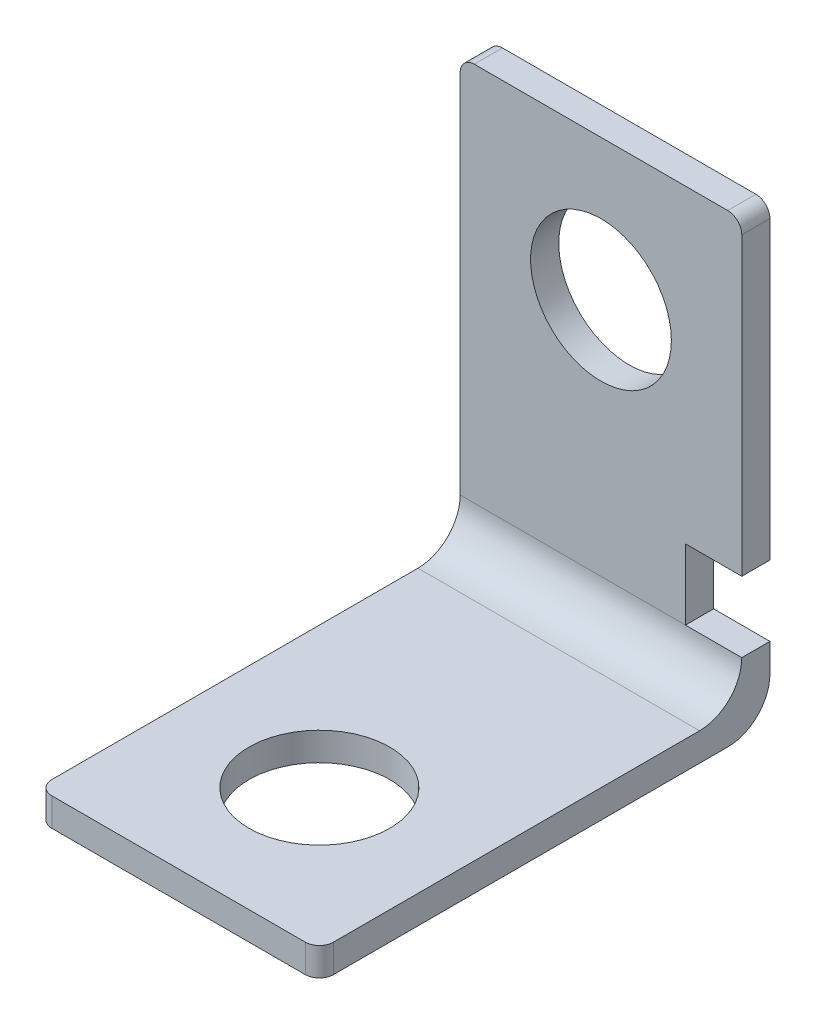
ISO-10303-21;
HEADER;
FILE_DESCRIPTION(('STEP AP214'),'2;1');
FILE_NAME('part.step','',(''),(''),'','','');
FILE_SCHEMA(('AUTOMOTIVE_DESIGN { 1 0 10303 214 1 1 1 1 }'));
ENDSEC;
DATA;
#1=APPLICATION_CONTEXT('core data for automotive mechanical design processes');
#2=APPLICATION_PROTOCOL_DEFINITION('international standard','automotive_design',2000,#1);
#3=PRODUCT_CONTEXT('',#1,'mechanical');
#4=PRODUCT('Part','Part','',(#3));
#5=PRODUCT_RELATED_PRODUCT_CATEGORY('part','',(#4));
#6=PRODUCT_DEFINITION_FORMATION('','',#4);
#7=PRODUCT_DEFINITION_CONTEXT('part definition',#1,'design');
#8=PRODUCT_DEFINITION('design','',#6,#7);
#9=PRODUCT_DEFINITION_SHAPE('','',#8);
#10=(LENGTH_UNIT() NAMED_UNIT(*) SI_UNIT(.MILLI.,.METRE.));
#11=(NAMED_UNIT(*) PLANE_ANGLE_UNIT() SI_UNIT($,.RADIAN.));
#12=(NAMED_UNIT(*) SI_UNIT($,.STERADIAN.) SOLID_ANGLE_UNIT());
#13=UNCERTAINTY_MEASURE_WITH_UNIT(LENGTH_MEASURE(1.E-05),#10,'distance_accuracy_value','');
#14=(GEOMETRIC_REPRESENTATION_CONTEXT(3) GLOBAL_UNCERTAINTY_ASSIGNED_CONTEXT((#13)) GLOBAL_UNIT_ASSIGNED_CONTEXT((#10,
#11,#12)) REPRESENTATION_CONTEXT('',''));
#15=CARTESIAN_POINT('',(0.,0.,0.));
#16=DIRECTION('',(0.,0.,1.));
#17=DIRECTION('',(1.,0.,0.));
#18=AXIS2_PLACEMENT_3D('',#15,#16,#17);
#19=CARTESIAN_POINT('',(20.,30.,-32.));
#20=DIRECTION('',(-1.,0.,0.));
#21=DIRECTION('',(0.,0.,1.));
#22=AXIS2_PLACEMENT_3D('',#19,#20,#21);
#23=PLANE('',#22);
#24=DIRECTION('',(0.,0.,-1.));
#25=VECTOR('',#24,1.);
#26=CARTESIAN_POINT('',(20.,0.,0.));
#27=LINE('',#26,#25);
#28=CARTESIAN_POINT('',(20.,0.,-1.));
#29=VERTEX_POINT('',#28);
#30=CARTESIAN_POINT('',(20.,0.,-27.));
#31=VERTEX_POINT('',#30);
#32=EDGE_CURVE('E177',#29,#31,#27,.T.);
#33=ORIENTED_EDGE('',*,*,#32,.F.);
#34=DIRECTION('',(0.,1.,0.));
#35=VECTOR('',#34,1.);
#36=CARTESIAN_POINT('',(20.,-2.,-1.));
#37=LINE('',#36,#35);
#38=CARTESIAN_POINT('',(20.,-2.,-1.));
#39=VERTEX_POINT('',#38);
#40=EDGE_CURVE('E238',#29,#39,#37,.F.);
#41=ORIENTED_EDGE('',*,*,#40,.T.);
#42=DIRECTION('',(0.,0.,-1.));
#43=VECTOR('',#42,1.);
#44=CARTESIAN_POINT('',(20.,-2.,0.));
#45=LINE('',#44,#43);
#46=CARTESIAN_POINT('',(20.,-2.,-29.));
#47=VERTEX_POINT('',#46);
#48=EDGE_CURVE('E179',#39,#47,#45,.T.);
#49=ORIENTED_EDGE('',*,*,#48,.T.);
#50=CARTESIAN_POINT('',(20.,1.,-29.));
#51=DIRECTION('',(-1.,0.,0.));
#52=DIRECTION('',(0.,0.,1.));
#53=AXIS2_PLACEMENT_3D('',#50,#51,#52);
#54=CIRCLE('',#53,3.);
#55=CARTESIAN_POINT('',(20.,1.,-32.));
#56=VERTEX_POINT('',#55);
#57=EDGE_CURVE('E206',#47,#56,#54,.F.);
#58=ORIENTED_EDGE('',*,*,#57,.T.);
#59=DIRECTION('',(0.,1.,0.));
#60=VECTOR('',#59,1.);
#61=CARTESIAN_POINT('',(20.,0.,-32.));
#62=LINE('',#61,#60);
#63=CARTESIAN_POINT('',(20.,3.,-32.));
#64=VERTEX_POINT('',#63);
#65=EDGE_CURVE('E166',#56,#64,#62,.T.);
#66=ORIENTED_EDGE('',*,*,#65,.T.);
#67=DIRECTION('',(0.,0.,1.));
#68=VECTOR('',#67,1.);
#69=CARTESIAN_POINT('',(20.,3.,-32.001));
#70=LINE('',#69,#68);
#71=CARTESIAN_POINT('',(20.,3.,-30.));
#72=VERTEX_POINT('',#71);
#73=EDGE_CURVE('E155',#64,#72,#70,.T.);
#74=ORIENTED_EDGE('',*,*,#73,.T.);
#75=CARTESIAN_POINT('',(20.,3.,-27.));
#76=DIRECTION('',(-1.,0.,0.));
#77=DIRECTION('',(0.,0.,1.));
#78=AXIS2_PLACEMENT_3D('',#75,#76,#77);
#79=CIRCLE('',#78,3.);
#80=EDGE_CURVE('E216',#72,#31,#79,.T.);
#81=ORIENTED_EDGE('',*,*,#80,.T.);
#82=EDGE_LOOP('',(#33,#41,#49,#58,#66,#74,#81));
#83=FACE_BOUND('',#82,.T.);
#84=ADVANCED_FACE('F32',(#83),#23,.F.);
#85=CARTESIAN_POINT('',(20.,-2.,0.));
#86=DIRECTION('',(0.,1.,0.));
#87=DIRECTION('',(0.,0.,1.));
#88=AXIS2_PLACEMENT_3D('',#85,#86,#87);
#89=PLANE('',#88);
#90=DIRECTION('',(-1.,0.,0.));
#91=VECTOR('',#90,1.);
#92=CARTESIAN_POINT('',(20.,-2.,0.));
#93=LINE('',#92,#91);
#94=CARTESIAN_POINT('',(19.,-2.,0.));
#95=VERTEX_POINT('',#94);
#96=CARTESIAN_POINT('',(1.,-2.,0.));
#97=VERTEX_POINT('',#96);
#98=EDGE_CURVE('E181',#95,#97,#93,.T.);
#99=ORIENTED_EDGE('',*,*,#98,.T.);
#100=CARTESIAN_POINT('',(1.,-2.,-1.));
#101=DIRECTION('',(0.,1.,0.));
#102=DIRECTION('',(0.,0.,1.));
#103=AXIS2_PLACEMENT_3D('',#100,#101,#102);
#104=CIRCLE('',#103,1.);
#105=CARTESIAN_POINT('',(0.,-2.,-1.));
#106=VERTEX_POINT('',#105);
#107=EDGE_CURVE('E236',#97,#106,#104,.F.);
#108=ORIENTED_EDGE('',*,*,#107,.T.);
#109=DIRECTION('',(0.,0.,-1.));
#110=VECTOR('',#109,1.);
#111=CARTESIAN_POINT('',(0.,-2.,0.));
#112=LINE('',#111,#110);
#113=CARTESIAN_POINT('',(0.,-2.,-29.));
#114=VERTEX_POINT('',#113);
#115=EDGE_CURVE('E167',#106,#114,#112,.T.);
#116=ORIENTED_EDGE('',*,*,#115,.T.);
#117=DIRECTION('',(-1.,0.,0.));
#118=VECTOR('',#117,1.);
#119=CARTESIAN_POINT('',(20.,-2.,-29.));
#120=LINE('',#119,#118);
#121=EDGE_CURVE('E203',#114,#47,#120,.F.);
#122=ORIENTED_EDGE('',*,*,#121,.T.);
#123=ORIENTED_EDGE('',*,*,#48,.F.);
#124=CARTESIAN_POINT('',(19.,-2.,-1.));
#125=DIRECTION('',(0.,1.,0.));
#126=DIRECTION('',(0.,0.,1.));
#127=AXIS2_PLACEMENT_3D('',#124,#125,#126);
#128=CIRCLE('',#127,1.);
#129=EDGE_CURVE('E234',#39,#95,#128,.F.);
#130=ORIENTED_EDGE('',*,*,#129,.T.);
#131=EDGE_LOOP('',(#99,#108,#116,#122,#123,#130));
#132=FACE_BOUND('',#131,.T.);
#133=CARTESIAN_POINT('',(10.,-2.,-10.));
#134=DIRECTION('',(0.,1.,0.));
#135=DIRECTION('',(0.,0.,1.));
#136=AXIS2_PLACEMENT_3D('',#133,#134,#135);
#137=CIRCLE('',#136,4.99999999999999);
#138=CARTESIAN_POINT('',(10.,-2.,-5.00000000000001));
#139=VERTEX_POINT('',#138);
#140=EDGE_CURVE('E174',#139,#139,#137,.F.);
#141=ORIENTED_EDGE('',*,*,#140,.F.);
#142=EDGE_LOOP('',(#141));
#143=FACE_BOUND('',#142,.T.);
#144=ADVANCED_FACE('F297',(#132,#143),#89,.F.);
#145=CARTESIAN_POINT('',(20.,0.,-32.));
#146=DIRECTION('',(0.,0.,1.));
#147=DIRECTION('',(1.,0.,0.));
#148=AXIS2_PLACEMENT_3D('',#145,#146,#147);
#149=PLANE('',#148);
#150=CARTESIAN_POINT('',(10.,20.,-32.));
#151=DIRECTION('',(0.,0.,1.));
#152=DIRECTION('',(1.,0.,0.));
#153=AXIS2_PLACEMENT_3D('',#150,#151,#152);
#154=CIRCLE('',#153,5.);
#155=CARTESIAN_POINT('',(15.,20.,-32.));
#156=VERTEX_POINT('',#155);
#157=EDGE_CURVE('E286',#156,#156,#154,.T.);
#158=ORIENTED_EDGE('',*,*,#157,.T.);
#159=EDGE_LOOP('',(#158));
#160=FACE_BOUND('',#159,.T.);
#161=DIRECTION('',(0.,1.,0.));
#162=VECTOR('',#161,1.);
#163=CARTESIAN_POINT('',(0.,0.,-32.));
#164=LINE('',#163,#162);
#165=CARTESIAN_POINT('',(0.,1.,-32.));
#166=VERTEX_POINT('',#165);
#167=CARTESIAN_POINT('',(0.,29.,-32.));
#168=VERTEX_POINT('',#167);
#169=EDGE_CURVE('E182',#166,#168,#164,.T.);
#170=ORIENTED_EDGE('',*,*,#169,.T.);
#171=CARTESIAN_POINT('',(1.,29.,-32.));
#172=DIRECTION('',(0.,0.,1.));
#173=DIRECTION('',(1.,0.,0.));
#174=AXIS2_PLACEMENT_3D('',#171,#172,#173);
#175=CIRCLE('',#174,1.);
#176=CARTESIAN_POINT('',(1.,30.,-32.));
#177=VERTEX_POINT('',#176);
#178=EDGE_CURVE('E241',#168,#177,#175,.F.);
#179=ORIENTED_EDGE('',*,*,#178,.T.);
#180=DIRECTION('',(-1.,0.,0.));
#181=VECTOR('',#180,1.);
#182=CARTESIAN_POINT('',(20.,30.,-32.));
#183=LINE('',#182,#181);
#184=CARTESIAN_POINT('',(19.,30.,-32.));
#185=VERTEX_POINT('',#184);
#186=EDGE_CURVE('E195',#185,#177,#183,.T.);
#187=ORIENTED_EDGE('',*,*,#186,.F.);
#188=CARTESIAN_POINT('',(19.,29.,-32.));
#189=DIRECTION('',(0.,0.,1.));
#190=DIRECTION('',(1.,0.,0.));
#191=AXIS2_PLACEMENT_3D('',#188,#189,#190);
#192=CIRCLE('',#191,1.);
#193=CARTESIAN_POINT('',(20.,29.,-32.));
#194=VERTEX_POINT('',#193);
#195=EDGE_CURVE('E165',#185,#194,#192,.F.);
#196=ORIENTED_EDGE('',*,*,#195,.T.);
#197=CARTESIAN_POINT('',(20.,8.,-32.));
#198=VERTEX_POINT('',#197);
#199=EDGE_CURVE('E158',#198,#194,#62,.T.);
#200=ORIENTED_EDGE('',*,*,#199,.F.);
#201=DIRECTION('',(1.,0.,0.));
#202=VECTOR('',#201,1.);
#203=CARTESIAN_POINT('',(20.,8.,-32.));
#204=LINE('',#203,#202);
#205=CARTESIAN_POINT('',(16.,8.,-32.));
#206=VERTEX_POINT('',#205);
#207=EDGE_CURVE('E143',#206,#198,#204,.T.);
#208=ORIENTED_EDGE('',*,*,#207,.F.);
#209=DIRECTION('',(0.,1.,0.));
#210=VECTOR('',#209,1.);
#211=CARTESIAN_POINT('',(16.,3.,-32.));
#212=LINE('',#211,#210);
#213=CARTESIAN_POINT('',(16.,3.,-32.));
#214=VERTEX_POINT('',#213);
#215=EDGE_CURVE('E273',#214,#206,#212,.T.);
#216=ORIENTED_EDGE('',*,*,#215,.F.);
#217=DIRECTION('',(-1.,0.,0.));
#218=VECTOR('',#217,1.);
#219=CARTESIAN_POINT('',(20.,3.,-32.));
#220=LINE('',#219,#218);
#221=EDGE_CURVE('E269',#64,#214,#220,.T.);
#222=ORIENTED_EDGE('',*,*,#221,.F.);
#223=ORIENTED_EDGE('',*,*,#65,.F.);
#224=DIRECTION('',(-1.,0.,0.));
#225=VECTOR('',#224,1.);
#226=CARTESIAN_POINT('',(20.,1.,-32.));
#227=LINE('',#226,#225);
#228=EDGE_CURVE('E197',#56,#166,#227,.T.);
#229=ORIENTED_EDGE('',*,*,#228,.T.);
#230=EDGE_LOOP('',(#170,#179,#187,#196,#200,#208,#216,#222,#223,#229));
#231=FACE_BOUND('',#230,.T.);
#232=ADVANCED_FACE('F163',(#160,#231),#149,.F.);
#233=CARTESIAN_POINT('',(20.,30.,-30.));
#234=DIRECTION('',(0.,1.,0.));
#235=DIRECTION('',(0.,0.,1.));
#236=AXIS2_PLACEMENT_3D('',#233,#234,#235);
#237=PLANE('',#236);
#238=ORIENTED_EDGE('',*,*,#186,.T.);
#239=DIRECTION('',(0.,0.,-1.));
#240=VECTOR('',#239,1.);
#241=CARTESIAN_POINT('',(1.,30.,-30.));
#242=LINE('',#241,#240);
#243=CARTESIAN_POINT('',(1.,30.,-30.));
#244=VERTEX_POINT('',#243);
#245=EDGE_CURVE('E53',#177,#244,#242,.F.);
#246=ORIENTED_EDGE('',*,*,#245,.T.);
#247=DIRECTION('',(-1.,0.,0.));
#248=VECTOR('',#247,1.);
#249=CARTESIAN_POINT('',(20.,30.,-30.));
#250=LINE('',#249,#248);
#251=CARTESIAN_POINT('',(19.,30.,-30.));
#252=VERTEX_POINT('',#251);
#253=EDGE_CURVE('E193',#252,#244,#250,.T.);
#254=ORIENTED_EDGE('',*,*,#253,.F.);
#255=DIRECTION('',(0.,0.,-1.));
#256=VECTOR('',#255,1.);
#257=CARTESIAN_POINT('',(19.,30.,-32.));
#258=LINE('',#257,#256);
#259=EDGE_CURVE('E243',#252,#185,#258,.T.);
#260=ORIENTED_EDGE('',*,*,#259,.T.);
#261=EDGE_LOOP('',(#238,#246,#254,#260));
#262=FACE_BOUND('',#261,.T.);
#263=ADVANCED_FACE('F262',(#262),#237,.T.);
#264=CARTESIAN_POINT('',(20.,0.,-30.));
#265=DIRECTION('',(0.,0.,1.));
#266=DIRECTION('',(1.,0.,0.));
#267=AXIS2_PLACEMENT_3D('',#264,#265,#266);
#268=PLANE('',#267);
#269=ORIENTED_EDGE('',*,*,#253,.T.);
#270=CARTESIAN_POINT('',(1.,29.,-30.));
#271=DIRECTION('',(0.,0.,1.));
#272=DIRECTION('',(1.,0.,0.));
#273=AXIS2_PLACEMENT_3D('',#270,#271,#272);
#274=CIRCLE('',#273,1.);
#275=CARTESIAN_POINT('',(0.,29.,-30.));
#276=VERTEX_POINT('',#275);
#277=EDGE_CURVE('E40',#244,#276,#274,.T.);
#278=ORIENTED_EDGE('',*,*,#277,.T.);
#279=DIRECTION('',(0.,1.,0.));
#280=VECTOR('',#279,1.);
#281=CARTESIAN_POINT('',(0.,0.,-30.));
#282=LINE('',#281,#280);
#283=CARTESIAN_POINT('',(0.,3.,-30.));
#284=VERTEX_POINT('',#283);
#285=EDGE_CURVE('E184',#284,#276,#282,.T.);
#286=ORIENTED_EDGE('',*,*,#285,.F.);
#287=DIRECTION('',(-1.,0.,0.));
#288=VECTOR('',#287,1.);
#289=CARTESIAN_POINT('',(20.,3.,-30.));
#290=LINE('',#289,#288);
#291=CARTESIAN_POINT('',(16.,3.,-30.));
#292=VERTEX_POINT('',#291);
#293=EDGE_CURVE('E211',#284,#292,#290,.F.);
#294=ORIENTED_EDGE('',*,*,#293,.T.);
#295=DIRECTION('',(0.,-1.,0.));
#296=VECTOR('',#295,1.);
#297=CARTESIAN_POINT('',(16.,3.,-30.));
#298=LINE('',#297,#296);
#299=CARTESIAN_POINT('',(16.,8.,-30.));
#300=VERTEX_POINT('',#299);
#301=EDGE_CURVE('E268',#300,#292,#298,.T.);
#302=ORIENTED_EDGE('',*,*,#301,.F.);
#303=DIRECTION('',(-1.,0.,0.));
#304=VECTOR('',#303,1.);
#305=CARTESIAN_POINT('',(20.,8.,-30.));
#306=LINE('',#305,#304);
#307=CARTESIAN_POINT('',(20.,8.,-30.));
#308=VERTEX_POINT('',#307);
#309=EDGE_CURVE('E267',#308,#300,#306,.T.);
#310=ORIENTED_EDGE('',*,*,#309,.F.);
#311=DIRECTION('',(0.,1.,0.));
#312=VECTOR('',#311,1.);
#313=CARTESIAN_POINT('',(20.,0.,-30.));
#314=LINE('',#313,#312);
#315=CARTESIAN_POINT('',(20.,29.,-30.));
#316=VERTEX_POINT('',#315);
#317=EDGE_CURVE('E159',#308,#316,#314,.T.);
#318=ORIENTED_EDGE('',*,*,#317,.T.);
#319=CARTESIAN_POINT('',(19.,29.,-30.));
#320=DIRECTION('',(0.,0.,1.));
#321=DIRECTION('',(1.,0.,0.));
#322=AXIS2_PLACEMENT_3D('',#319,#320,#321);
#323=CIRCLE('',#322,1.);
#324=EDGE_CURVE('E247',#316,#252,#323,.T.);
#325=ORIENTED_EDGE('',*,*,#324,.T.);
#326=EDGE_LOOP('',(#269,#278,#286,#294,#302,#310,#318,#325));
#327=FACE_BOUND('',#326,.T.);
#328=CARTESIAN_POINT('',(10.,20.,-30.));
#329=DIRECTION('',(0.,0.,1.));
#330=DIRECTION('',(1.,0.,0.));
#331=AXIS2_PLACEMENT_3D('',#328,#329,#330);
#332=CIRCLE('',#331,4.99999999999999);
#333=CARTESIAN_POINT('',(15.,20.,-30.));
#334=VERTEX_POINT('',#333);
#335=EDGE_CURVE('E154',#334,#334,#332,.T.);
#336=ORIENTED_EDGE('',*,*,#335,.F.);
#337=EDGE_LOOP('',(#336));
#338=FACE_BOUND('',#337,.T.);
#339=ADVANCED_FACE('F251',(#327,#338),#268,.T.);
#340=CARTESIAN_POINT('',(20.,0.,0.));
#341=DIRECTION('',(0.,1.,0.));
#342=DIRECTION('',(0.,0.,1.));
#343=AXIS2_PLACEMENT_3D('',#340,#341,#342);
#344=PLANE('',#343);
#345=CARTESIAN_POINT('',(10.,0.,-10.));
#346=DIRECTION('',(0.,1.,0.));
#347=DIRECTION('',(0.,0.,1.));
#348=AXIS2_PLACEMENT_3D('',#345,#346,#347);
#349=CIRCLE('',#348,4.99999999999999);
#350=CARTESIAN_POINT('',(10.,0.,-5.00000000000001));
#351=VERTEX_POINT('',#350);
#352=EDGE_CURVE('E288',#351,#351,#349,.T.);
#353=ORIENTED_EDGE('',*,*,#352,.F.);
#354=EDGE_LOOP('',(#353));
#355=FACE_BOUND('',#354,.T.);
#356=DIRECTION('',(0.,0.,-1.));
#357=VECTOR('',#356,1.);
#358=CARTESIAN_POINT('',(0.,0.,0.));
#359=LINE('',#358,#357);
#360=CARTESIAN_POINT('',(0.,0.,-1.));
#361=VERTEX_POINT('',#360);
#362=CARTESIAN_POINT('',(0.,0.,-27.));
#363=VERTEX_POINT('',#362);
#364=EDGE_CURVE('E170',#361,#363,#359,.T.);
#365=ORIENTED_EDGE('',*,*,#364,.F.);
#366=CARTESIAN_POINT('',(1.,0.,-1.));
#367=DIRECTION('',(0.,1.,0.));
#368=DIRECTION('',(0.,0.,1.));
#369=AXIS2_PLACEMENT_3D('',#366,#367,#368);
#370=CIRCLE('',#369,1.);
#371=CARTESIAN_POINT('',(1.,0.,0.));
#372=VERTEX_POINT('',#371);
#373=EDGE_CURVE('E227',#361,#372,#370,.T.);
#374=ORIENTED_EDGE('',*,*,#373,.T.);
#375=DIRECTION('',(-1.,0.,0.));
#376=VECTOR('',#375,1.);
#377=CARTESIAN_POINT('',(20.,0.,0.));
#378=LINE('',#377,#376);
#379=CARTESIAN_POINT('',(19.,0.,0.));
#380=VERTEX_POINT('',#379);
#381=EDGE_CURVE('E190',#380,#372,#378,.T.);
#382=ORIENTED_EDGE('',*,*,#381,.F.);
#383=CARTESIAN_POINT('',(19.,0.,-1.));
#384=DIRECTION('',(0.,1.,0.));
#385=DIRECTION('',(0.,0.,1.));
#386=AXIS2_PLACEMENT_3D('',#383,#384,#385);
#387=CIRCLE('',#386,1.);
#388=EDGE_CURVE('E225',#380,#29,#387,.T.);
#389=ORIENTED_EDGE('',*,*,#388,.T.);
#390=ORIENTED_EDGE('',*,*,#32,.T.);
#391=DIRECTION('',(-1.,0.,0.));
#392=VECTOR('',#391,1.);
#393=CARTESIAN_POINT('',(0.,0.,-27.));
#394=LINE('',#393,#392);
#395=EDGE_CURVE('E208',#31,#363,#394,.T.);
#396=ORIENTED_EDGE('',*,*,#395,.T.);
#397=EDGE_LOOP('',(#365,#374,#382,#389,#390,#396));
#398=FACE_BOUND('',#397,.T.);
#399=ADVANCED_FACE('F314',(#355,#398),#344,.T.);
#400=CARTESIAN_POINT('',(20.,-2.,0.));
#401=DIRECTION('',(0.,0.,1.));
#402=DIRECTION('',(1.,0.,0.));
#403=AXIS2_PLACEMENT_3D('',#400,#401,#402);
#404=PLANE('',#403);
#405=ORIENTED_EDGE('',*,*,#381,.T.);
#406=DIRECTION('',(0.,1.,0.));
#407=VECTOR('',#406,1.);
#408=CARTESIAN_POINT('',(1.,-2.,0.));
#409=LINE('',#408,#407);
#410=EDGE_CURVE('E232',#372,#97,#409,.F.);
#411=ORIENTED_EDGE('',*,*,#410,.T.);
#412=ORIENTED_EDGE('',*,*,#98,.F.);
#413=DIRECTION('',(0.,1.,0.));
#414=VECTOR('',#413,1.);
#415=CARTESIAN_POINT('',(19.,0.,0.));
#416=LINE('',#415,#414);
#417=EDGE_CURVE('E229',#95,#380,#416,.T.);
#418=ORIENTED_EDGE('',*,*,#417,.T.);
#419=EDGE_LOOP('',(#405,#411,#412,#418));
#420=FACE_BOUND('',#419,.T.);
#421=ADVANCED_FACE('F311',(#420),#404,.T.);
#422=ORIENTED_EDGE('',*,*,#199,.T.);
#423=DIRECTION('',(0.,0.,-1.));
#424=VECTOR('',#423,1.);
#425=CARTESIAN_POINT('',(20.,29.,-30.));
#426=LINE('',#425,#424);
#427=EDGE_CURVE('E11',#194,#316,#426,.F.);
#428=ORIENTED_EDGE('',*,*,#427,.T.);
#429=ORIENTED_EDGE('',*,*,#317,.F.);
#430=DIRECTION('',(0.,0.,1.));
#431=VECTOR('',#430,1.);
#432=CARTESIAN_POINT('',(20.,8.,-32.001));
#433=LINE('',#432,#431);
#434=EDGE_CURVE('E147',#198,#308,#433,.T.);
#435=ORIENTED_EDGE('',*,*,#434,.F.);
#436=EDGE_LOOP('',(#422,#428,#429,#435));
#437=FACE_BOUND('',#436,.T.);
#438=ADVANCED_FACE('F157',(#437),#23,.F.);
#439=CARTESIAN_POINT('',(0.,30.,-32.));
#440=DIRECTION('',(-1.,0.,0.));
#441=DIRECTION('',(0.,0.,1.));
#442=AXIS2_PLACEMENT_3D('',#439,#440,#441);
#443=PLANE('',#442);
#444=ORIENTED_EDGE('',*,*,#115,.F.);
#445=DIRECTION('',(0.,1.,0.));
#446=VECTOR('',#445,1.);
#447=CARTESIAN_POINT('',(0.,30.,-1.));
#448=LINE('',#447,#446);
#449=EDGE_CURVE('E222',#106,#361,#448,.T.);
#450=ORIENTED_EDGE('',*,*,#449,.T.);
#451=ORIENTED_EDGE('',*,*,#364,.T.);
#452=CARTESIAN_POINT('',(0.,3.,-27.));
#453=DIRECTION('',(-1.,0.,0.));
#454=DIRECTION('',(0.,0.,1.));
#455=AXIS2_PLACEMENT_3D('',#452,#453,#454);
#456=CIRCLE('',#455,3.);
#457=EDGE_CURVE('E214',#363,#284,#456,.F.);
#458=ORIENTED_EDGE('',*,*,#457,.T.);
#459=ORIENTED_EDGE('',*,*,#285,.T.);
#460=DIRECTION('',(0.,0.,-1.));
#461=VECTOR('',#460,1.);
#462=CARTESIAN_POINT('',(0.,29.,-32.));
#463=LINE('',#462,#461);
#464=EDGE_CURVE('E219',#276,#168,#463,.T.);
#465=ORIENTED_EDGE('',*,*,#464,.T.);
#466=ORIENTED_EDGE('',*,*,#169,.F.);
#467=CARTESIAN_POINT('',(0.,1.,-29.));
#468=DIRECTION('',(-1.,0.,0.));
#469=DIRECTION('',(0.,0.,1.));
#470=AXIS2_PLACEMENT_3D('',#467,#468,#469);
#471=CIRCLE('',#470,3.);
#472=EDGE_CURVE('E200',#166,#114,#471,.T.);
#473=ORIENTED_EDGE('',*,*,#472,.T.);
#474=EDGE_LOOP('',(#444,#450,#451,#458,#459,#465,#466,#473));
#475=FACE_BOUND('',#474,.T.);
#476=ADVANCED_FACE('F258',(#475),#443,.T.);
#477=CARTESIAN_POINT('',(10.,0.,-10.));
#478=DIRECTION('',(0.,1.,0.));
#479=DIRECTION('',(0.,0.,1.));
#480=AXIS2_PLACEMENT_3D('',#477,#478,#479);
#481=CYLINDRICAL_SURFACE('',#480,4.99999999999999);
#482=ORIENTED_EDGE('',*,*,#140,.T.);
#483=EDGE_LOOP('',(#482));
#484=FACE_BOUND('',#483,.T.);
#485=ORIENTED_EDGE('',*,*,#352,.T.);
#486=EDGE_LOOP('',(#485));
#487=FACE_BOUND('',#486,.T.);
#488=ADVANCED_FACE('F295',(#484,#487),#481,.F.);
#489=CARTESIAN_POINT('',(20.,1.,-29.));
#490=DIRECTION('',(-1.,0.,0.));
#491=DIRECTION('',(0.,0.,1.));
#492=AXIS2_PLACEMENT_3D('',#489,#490,#491);
#493=CYLINDRICAL_SURFACE('',#492,3.);
#494=ORIENTED_EDGE('',*,*,#57,.F.);
#495=ORIENTED_EDGE('',*,*,#121,.F.);
#496=ORIENTED_EDGE('',*,*,#472,.F.);
#497=ORIENTED_EDGE('',*,*,#228,.F.);
#498=EDGE_LOOP('',(#494,#495,#496,#497));
#499=FACE_BOUND('',#498,.T.);
#500=ADVANCED_FACE('F323',(#499),#493,.T.);
#501=CARTESIAN_POINT('',(20.,3.,-27.));
#502=DIRECTION('',(1.,0.,0.));
#503=DIRECTION('',(0.,0.,-1.));
#504=AXIS2_PLACEMENT_3D('',#501,#502,#503);
#505=CYLINDRICAL_SURFACE('',#504,3.);
#506=ORIENTED_EDGE('',*,*,#80,.F.);
#507=DIRECTION('',(1.,0.,0.));
#508=VECTOR('',#507,1.);
#509=CARTESIAN_POINT('',(20.,3.,-30.));
#510=LINE('',#509,#508);
#511=EDGE_CURVE('E160',#292,#72,#510,.T.);
#512=ORIENTED_EDGE('',*,*,#511,.F.);
#513=ORIENTED_EDGE('',*,*,#293,.F.);
#514=ORIENTED_EDGE('',*,*,#457,.F.);
#515=ORIENTED_EDGE('',*,*,#395,.F.);
#516=EDGE_LOOP('',(#506,#512,#513,#514,#515));
#517=FACE_BOUND('',#516,.T.);
#518=ADVANCED_FACE('F326',(#517),#505,.F.);
#519=CARTESIAN_POINT('',(10.,20.,-30.));
#520=DIRECTION('',(0.,0.,1.));
#521=DIRECTION('',(1.,0.,0.));
#522=AXIS2_PLACEMENT_3D('',#519,#520,#521);
#523=CYLINDRICAL_SURFACE('',#522,4.99999999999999);
#524=ORIENTED_EDGE('',*,*,#157,.F.);
#525=EDGE_LOOP('',(#524));
#526=FACE_BOUND('',#525,.T.);
#527=ORIENTED_EDGE('',*,*,#335,.T.);
#528=EDGE_LOOP('',(#527));
#529=FACE_BOUND('',#528,.T.);
#530=ADVANCED_FACE('F330',(#526,#529),#523,.F.);
#531=CARTESIAN_POINT('',(20.,3.,-32.001));
#532=DIRECTION('',(0.,-1.,0.));
#533=DIRECTION('',(1.,0.,0.));
#534=AXIS2_PLACEMENT_3D('',#531,#532,#533);
#535=PLANE('',#534);
#536=ORIENTED_EDGE('',*,*,#221,.T.);
#537=DIRECTION('',(0.,0.,1.));
#538=VECTOR('',#537,1.);
#539=CARTESIAN_POINT('',(16.,3.,-32.001));
#540=LINE('',#539,#538);
#541=EDGE_CURVE('E280',#214,#292,#540,.T.);
#542=ORIENTED_EDGE('',*,*,#541,.T.);
#543=ORIENTED_EDGE('',*,*,#511,.T.);
#544=ORIENTED_EDGE('',*,*,#73,.F.);
#545=EDGE_LOOP('',(#536,#542,#543,#544));
#546=FACE_BOUND('',#545,.T.);
#547=ADVANCED_FACE('F437',(#546),#535,.F.);
#548=CARTESIAN_POINT('',(16.,3.,-32.001));
#549=DIRECTION('',(-1.,0.,0.));
#550=DIRECTION('',(0.,0.,1.));
#551=AXIS2_PLACEMENT_3D('',#548,#549,#550);
#552=PLANE('',#551);
#553=ORIENTED_EDGE('',*,*,#215,.T.);
#554=DIRECTION('',(0.,0.,1.));
#555=VECTOR('',#554,1.);
#556=CARTESIAN_POINT('',(16.,8.,-32.001));
#557=LINE('',#556,#555);
#558=EDGE_CURVE('E149',#206,#300,#557,.T.);
#559=ORIENTED_EDGE('',*,*,#558,.T.);
#560=ORIENTED_EDGE('',*,*,#301,.T.);
#561=ORIENTED_EDGE('',*,*,#541,.F.);
#562=EDGE_LOOP('',(#553,#559,#560,#561));
#563=FACE_BOUND('',#562,.T.);
#564=ADVANCED_FACE('F428',(#563),#552,.F.);
#565=CARTESIAN_POINT('',(20.,8.,-32.001));
#566=DIRECTION('',(0.,1.,0.));
#567=DIRECTION('',(-1.,0.,0.));
#568=AXIS2_PLACEMENT_3D('',#565,#566,#567);
#569=PLANE('',#568);
#570=ORIENTED_EDGE('',*,*,#207,.T.);
#571=ORIENTED_EDGE('',*,*,#434,.T.);
#572=ORIENTED_EDGE('',*,*,#309,.T.);
#573=ORIENTED_EDGE('',*,*,#558,.F.);
#574=EDGE_LOOP('',(#570,#571,#572,#573));
#575=FACE_BOUND('',#574,.T.);
#576=ADVANCED_FACE('F145',(#575),#569,.F.);
#577=CARTESIAN_POINT('',(1.,30.,-1.));
#578=DIRECTION('',(0.,1.,0.));
#579=DIRECTION('',(0.,0.,1.));
#580=AXIS2_PLACEMENT_3D('',#577,#578,#579);
#581=CYLINDRICAL_SURFACE('',#580,1.);
#582=ORIENTED_EDGE('',*,*,#107,.F.);
#583=ORIENTED_EDGE('',*,*,#410,.F.);
#584=ORIENTED_EDGE('',*,*,#373,.F.);
#585=ORIENTED_EDGE('',*,*,#449,.F.);
#586=EDGE_LOOP('',(#582,#583,#584,#585));
#587=FACE_BOUND('',#586,.T.);
#588=ADVANCED_FACE('F332',(#587),#581,.T.);
#589=CARTESIAN_POINT('',(19.,-2.,-1.));
#590=DIRECTION('',(0.,-1.,0.));
#591=DIRECTION('',(0.,0.,-1.));
#592=AXIS2_PLACEMENT_3D('',#589,#590,#591);
#593=CYLINDRICAL_SURFACE('',#592,1.);
#594=ORIENTED_EDGE('',*,*,#129,.F.);
#595=ORIENTED_EDGE('',*,*,#40,.F.);
#596=ORIENTED_EDGE('',*,*,#388,.F.);
#597=ORIENTED_EDGE('',*,*,#417,.F.);
#598=EDGE_LOOP('',(#594,#595,#596,#597));
#599=FACE_BOUND('',#598,.T.);
#600=ADVANCED_FACE('F335',(#599),#593,.T.);
#601=CARTESIAN_POINT('',(1.,29.,-32.));
#602=DIRECTION('',(0.,0.,-1.));
#603=DIRECTION('',(-1.,0.,0.));
#604=AXIS2_PLACEMENT_3D('',#601,#602,#603);
#605=CYLINDRICAL_SURFACE('',#604,1.);
#606=ORIENTED_EDGE('',*,*,#277,.F.);
#607=ORIENTED_EDGE('',*,*,#245,.F.);
#608=ORIENTED_EDGE('',*,*,#178,.F.);
#609=ORIENTED_EDGE('',*,*,#464,.F.);
#610=EDGE_LOOP('',(#606,#607,#608,#609));
#611=FACE_BOUND('',#610,.T.);
#612=ADVANCED_FACE('F261',(#611),#605,.T.);
#613=CARTESIAN_POINT('',(19.,29.,-30.));
#614=DIRECTION('',(0.,0.,1.));
#615=DIRECTION('',(1.,0.,0.));
#616=AXIS2_PLACEMENT_3D('',#613,#614,#615);
#617=CYLINDRICAL_SURFACE('',#616,1.);
#618=ORIENTED_EDGE('',*,*,#324,.F.);
#619=ORIENTED_EDGE('',*,*,#427,.F.);
#620=ORIENTED_EDGE('',*,*,#195,.F.);
#621=ORIENTED_EDGE('',*,*,#259,.F.);
#622=EDGE_LOOP('',(#618,#619,#620,#621));
#623=FACE_BOUND('',#622,.T.);
#624=ADVANCED_FACE('F34',(#623),#617,.T.);
#625=CLOSED_SHELL('',(#84,#144,#232,#263,#339,#399,#421,#438,#476,#488,#500,#518,#530,#547,#564,
#576,#588,#600,#612,#624));
#626=MANIFOLD_SOLID_BREP('B2',#625);
#627=ADVANCED_BREP_SHAPE_REPRESENTATION('',(#18,#626),#14);
#628=SHAPE_DEFINITION_REPRESENTATION(#9,#627);
ENDSEC;
END-ISO-10303-21;
